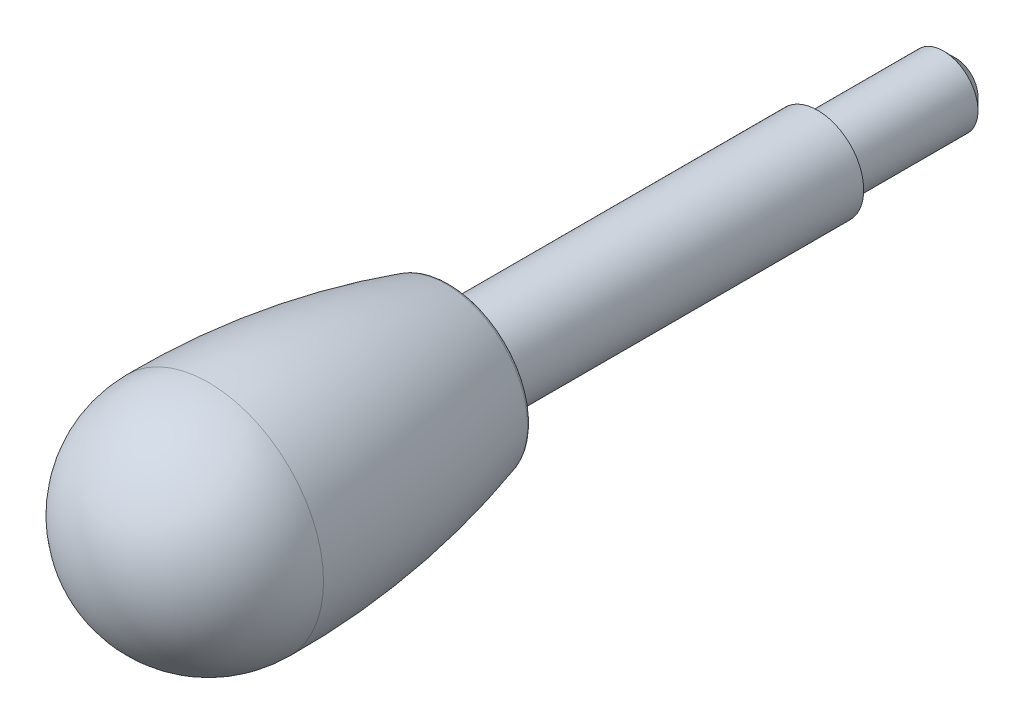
ISO-10303-21;
HEADER;
FILE_DESCRIPTION(('STEP AP214'),'2;1');
FILE_NAME('part.step','',(''),(''),'','','');
FILE_SCHEMA(('AUTOMOTIVE_DESIGN { 1 0 10303 214 1 1 1 1 }'));
ENDSEC;
DATA;
#1=APPLICATION_CONTEXT('core data for automotive mechanical design processes');
#2=APPLICATION_PROTOCOL_DEFINITION('international standard','automotive_design',2000,#1);
#3=PRODUCT_CONTEXT('',#1,'mechanical');
#4=PRODUCT('Part','Part','',(#3));
#5=PRODUCT_RELATED_PRODUCT_CATEGORY('part','',(#4));
#6=PRODUCT_DEFINITION_FORMATION('','',#4);
#7=PRODUCT_DEFINITION_CONTEXT('part definition',#1,'design');
#8=PRODUCT_DEFINITION('design','',#6,#7);
#9=PRODUCT_DEFINITION_SHAPE('','',#8);
#10=(LENGTH_UNIT() NAMED_UNIT(*) SI_UNIT(.MILLI.,.METRE.));
#11=(NAMED_UNIT(*) PLANE_ANGLE_UNIT() SI_UNIT($,.RADIAN.));
#12=(NAMED_UNIT(*) SI_UNIT($,.STERADIAN.) SOLID_ANGLE_UNIT());
#13=UNCERTAINTY_MEASURE_WITH_UNIT(LENGTH_MEASURE(1.E-05),#10,'distance_accuracy_value','');
#14=(GEOMETRIC_REPRESENTATION_CONTEXT(3) GLOBAL_UNCERTAINTY_ASSIGNED_CONTEXT((#13)) GLOBAL_UNIT_ASSIGNED_CONTEXT((#10,
#11,#12)) REPRESENTATION_CONTEXT('',''));
#15=CARTESIAN_POINT('',(0.,0.,0.));
#16=DIRECTION('',(0.,0.,1.));
#17=DIRECTION('',(1.,0.,0.));
#18=AXIS2_PLACEMENT_3D('',#15,#16,#17);
#19=CARTESIAN_POINT('',(0.,0.,-15.3042259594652));
#20=DIRECTION('',(0.,0.,-1.));
#21=DIRECTION('',(-1.,0.,0.));
#22=AXIS2_PLACEMENT_3D('',#19,#20,#21);
#23=CYLINDRICAL_SURFACE('',#22,3.);
#24=CARTESIAN_POINT('',(0.,0.,-10.9415803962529));
#25=DIRECTION('',(0.,0.,-1.));
#26=DIRECTION('',(-1.,0.,0.));
#27=AXIS2_PLACEMENT_3D('',#24,#25,#26);
#28=CIRCLE('',#27,3.);
#29=CARTESIAN_POINT('',(-3.,0.,-10.9415803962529));
#30=VERTEX_POINT('',#29);
#31=EDGE_CURVE('E40',#30,#30,#28,.T.);
#32=ORIENTED_EDGE('',*,*,#31,.F.);
#33=EDGE_LOOP('',(#32));
#34=FACE_BOUND('',#33,.T.);
#35=CARTESIAN_POINT('',(0.,0.,0.));
#36=DIRECTION('',(0.,0.,-1.));
#37=DIRECTION('',(-1.,0.,0.));
#38=AXIS2_PLACEMENT_3D('',#35,#36,#37);
#39=CIRCLE('',#38,3.);
#40=CARTESIAN_POINT('',(-3.,0.,0.));
#41=VERTEX_POINT('',#40);
#42=EDGE_CURVE('E8',#41,#41,#39,.T.);
#43=ORIENTED_EDGE('',*,*,#42,.T.);
#44=EDGE_LOOP('',(#43));
#45=FACE_BOUND('',#44,.T.);
#46=ADVANCED_FACE('F12',(#34,#45),#23,.T.);
#47=CARTESIAN_POINT('',(0.,-4.,0.));
#48=DIRECTION('',(0.,0.,1.));
#49=DIRECTION('',(1.,0.,0.));
#50=AXIS2_PLACEMENT_3D('',#47,#48,#49);
#51=PLANE('',#50);
#52=ORIENTED_EDGE('',*,*,#42,.F.);
#53=EDGE_LOOP('',(#52));
#54=FACE_BOUND('',#53,.T.);
#55=CARTESIAN_POINT('',(0.,0.,0.));
#56=DIRECTION('',(0.,0.,-1.));
#57=DIRECTION('',(-1.,0.,0.));
#58=AXIS2_PLACEMENT_3D('',#55,#56,#57);
#59=CIRCLE('',#58,4.);
#60=CARTESIAN_POINT('',(-4.,0.,0.));
#61=VERTEX_POINT('',#60);
#62=EDGE_CURVE('E18',#61,#61,#59,.T.);
#63=ORIENTED_EDGE('',*,*,#62,.T.);
#64=EDGE_LOOP('',(#63));
#65=FACE_BOUND('',#64,.T.);
#66=ADVANCED_FACE('F47',(#54,#65),#51,.F.);
#67=CARTESIAN_POINT('',(0.,0.,-15.3042259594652));
#68=DIRECTION('',(0.,0.,-1.));
#69=DIRECTION('',(-1.,0.,0.));
#70=AXIS2_PLACEMENT_3D('',#67,#68,#69);
#71=CYLINDRICAL_SURFACE('',#70,4.);
#72=ORIENTED_EDGE('',*,*,#62,.F.);
#73=EDGE_LOOP('',(#72));
#74=FACE_BOUND('',#73,.T.);
#75=CARTESIAN_POINT('',(0.,0.,32.));
#76=DIRECTION('',(0.,0.,-1.));
#77=DIRECTION('',(-1.,0.,0.));
#78=AXIS2_PLACEMENT_3D('',#75,#76,#77);
#79=CIRCLE('',#78,4.);
#80=CARTESIAN_POINT('',(-4.,0.,32.));
#81=VERTEX_POINT('',#80);
#82=EDGE_CURVE('E22',#81,#81,#79,.T.);
#83=ORIENTED_EDGE('',*,*,#82,.T.);
#84=EDGE_LOOP('',(#83));
#85=FACE_BOUND('',#84,.T.);
#86=ADVANCED_FACE('F53',(#74,#85),#71,.T.);
#87=CARTESIAN_POINT('',(0.,-6.62794066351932,32.));
#88=DIRECTION('',(0.,0.,1.));
#89=DIRECTION('',(1.,0.,0.));
#90=AXIS2_PLACEMENT_3D('',#87,#88,#89);
#91=PLANE('',#90);
#92=ORIENTED_EDGE('',*,*,#82,.F.);
#93=EDGE_LOOP('',(#92));
#94=FACE_BOUND('',#93,.T.);
#95=CARTESIAN_POINT('',(0.,0.,32.));
#96=DIRECTION('',(0.,0.,-1.));
#97=DIRECTION('',(-1.,0.,0.));
#98=AXIS2_PLACEMENT_3D('',#95,#96,#97);
#99=CIRCLE('',#98,6.62794066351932);
#100=CARTESIAN_POINT('',(-6.62794066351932,0.,32.));
#101=VERTEX_POINT('',#100);
#102=EDGE_CURVE('E26',#101,#101,#99,.T.);
#103=ORIENTED_EDGE('',*,*,#102,.T.);
#104=EDGE_LOOP('',(#103));
#105=FACE_BOUND('',#104,.T.);
#106=ADVANCED_FACE('F59',(#94,#105),#91,.F.);
#107=CARTESIAN_POINT('',(0.,0.,32.5));
#108=DIRECTION('',(0.,0.,-1.));
#109=DIRECTION('',(-1.,0.,0.));
#110=AXIS2_PLACEMENT_3D('',#107,#108,#109);
#111=TOROIDAL_SURFACE('',#110,6.62794066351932,0.500000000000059);
#112=ORIENTED_EDGE('',*,*,#102,.F.);
#113=EDGE_LOOP('',(#112));
#114=FACE_BOUND('',#113,.T.);
#115=CARTESIAN_POINT('',(0.,0.,32.357660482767));
#116=DIRECTION('',(0.,0.,-1.));
#117=DIRECTION('',(-1.,0.,0.));
#118=AXIS2_PLACEMENT_3D('',#115,#116,#117);
#119=CIRCLE('',#118,7.10725210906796);
#120=CARTESIAN_POINT('',(-7.10725210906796,0.,32.357660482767));
#121=VERTEX_POINT('',#120);
#122=EDGE_CURVE('E31',#121,#121,#119,.T.);
#123=ORIENTED_EDGE('',*,*,#122,.T.);
#124=EDGE_LOOP('',(#123));
#125=FACE_BOUND('',#124,.T.);
#126=ADVANCED_FACE('F65',(#114,#125),#111,.T.);
#127=CARTESIAN_POINT('',(0.,0.,52.2851928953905));
#128=DIRECTION('',(0.,0.,-1.));
#129=DIRECTION('',(-1.,0.,0.));
#130=AXIS2_PLACEMENT_3D('',#127,#128,#129);
#131=DEGENERATE_TOROIDAL_SURFACE('',#130,59.9963502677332,70.,.F.);
#132=ORIENTED_EDGE('',*,*,#122,.F.);
#133=EDGE_LOOP('',(#132));
#134=FACE_BOUND('',#133,.T.);
#135=CARTESIAN_POINT('',(0.,0.,53.));
#136=DIRECTION('',(0.,0.,-1.));
#137=DIRECTION('',(-1.,0.,0.));
#138=AXIS2_PLACEMENT_3D('',#135,#136,#137);
#139=CIRCLE('',#138,10.);
#140=CARTESIAN_POINT('',(-10.,0.,53.));
#141=VERTEX_POINT('',#140);
#142=EDGE_CURVE('E34',#141,#141,#139,.T.);
#143=ORIENTED_EDGE('',*,*,#142,.T.);
#144=EDGE_LOOP('',(#143));
#145=FACE_BOUND('',#144,.T.);
#146=ADVANCED_FACE('F69',(#134,#145),#131,.F.);
#147=CARTESIAN_POINT('',(0.,0.,53.));
#148=DIRECTION('',(-1.,0.,0.));
#149=DIRECTION('',(0.,0.,1.));
#150=AXIS2_PLACEMENT_3D('',#147,#148,#149);
#151=SPHERICAL_SURFACE('',#150,10.);
#152=CARTESIAN_POINT('',(0.,0.,53.));
#153=DIRECTION('',(0.,0.,-1.));
#154=DIRECTION('',(-1.,0.,0.));
#155=AXIS2_PLACEMENT_3D('',#152,#153,#154);
#156=SPHERICAL_SURFACE('',#155,10.);
#157=ORIENTED_EDGE('',*,*,#142,.F.);
#158=EDGE_LOOP('',(#157));
#159=FACE_BOUND('',#158,.T.);
#160=ADVANCED_FACE('F73',(#159),#156,.T.);
#161=CARTESIAN_POINT('',(0.,0.,-12.));
#162=DIRECTION('',(0.,0.,-1.));
#163=DIRECTION('',(-1.,0.,0.));
#164=AXIS2_PLACEMENT_3D('',#161,#162,#163);
#165=PLANE('',#164);
#166=CARTESIAN_POINT('',(0.,0.,-12.));
#167=DIRECTION('',(0.,0.,-1.));
#168=DIRECTION('',(-1.,0.,0.));
#169=AXIS2_PLACEMENT_3D('',#166,#167,#168);
#170=CIRCLE('',#169,1.94158039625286);
#171=CARTESIAN_POINT('',(-1.94158039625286,0.,-12.));
#172=VERTEX_POINT('',#171);
#173=EDGE_CURVE('E37',#172,#172,#170,.T.);
#174=ORIENTED_EDGE('',*,*,#173,.T.);
#175=EDGE_LOOP('',(#174));
#176=FACE_BOUND('',#175,.T.);
#177=ADVANCED_FACE('F77',(#176),#165,.T.);
#178=CARTESIAN_POINT('',(0.,0.,-10.9415803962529));
#179=DIRECTION('',(0.,0.,1.));
#180=DIRECTION('',(1.,0.,0.));
#181=AXIS2_PLACEMENT_3D('',#178,#179,#180);
#182=CONICAL_SURFACE('',#181,3.,0.785398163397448);
#183=ORIENTED_EDGE('',*,*,#173,.F.);
#184=EDGE_LOOP('',(#183));
#185=FACE_BOUND('',#184,.T.);
#186=ORIENTED_EDGE('',*,*,#31,.T.);
#187=EDGE_LOOP('',(#186));
#188=FACE_BOUND('',#187,.T.);
#189=ADVANCED_FACE('F44',(#185,#188),#182,.T.);
#190=CLOSED_SHELL('',(#46,#66,#86,#106,#126,#146,#160,#177,#189));
#191=MANIFOLD_SOLID_BREP('B1',#190);
#192=ADVANCED_BREP_SHAPE_REPRESENTATION('',(#18,#191),#14);
#193=SHAPE_DEFINITION_REPRESENTATION(#9,#192);
ENDSEC;
END-ISO-10303-21;
